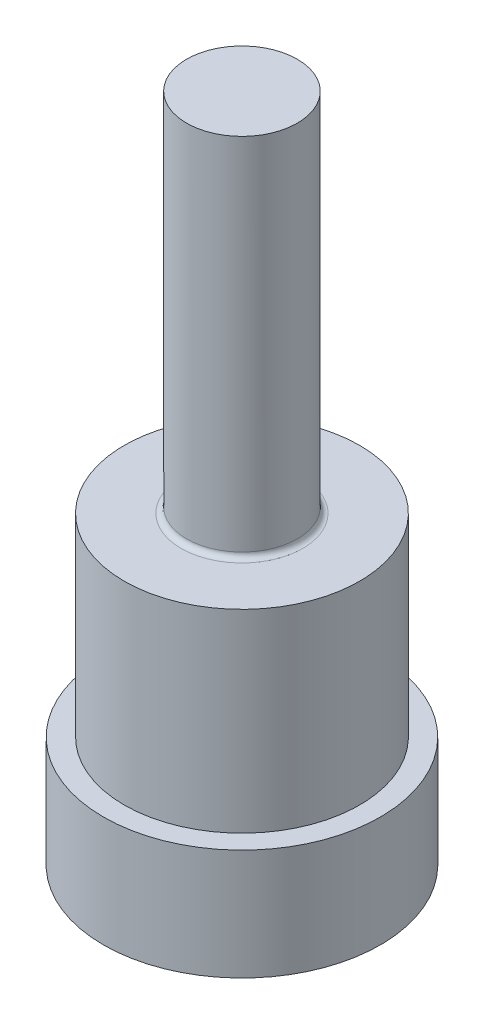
ISO-10303-21;
HEADER;
FILE_DESCRIPTION(('STEP AP214'),'2;1');
FILE_NAME('part.step','',(''),(''),'','','');
FILE_SCHEMA(('AUTOMOTIVE_DESIGN { 1 0 10303 214 1 1 1 1 }'));
ENDSEC;
DATA;
#1=APPLICATION_CONTEXT('core data for automotive mechanical design processes');
#2=APPLICATION_PROTOCOL_DEFINITION('international standard','automotive_design',2000,#1);
#3=PRODUCT_CONTEXT('',#1,'mechanical');
#4=PRODUCT('Part','Part','',(#3));
#5=PRODUCT_RELATED_PRODUCT_CATEGORY('part','',(#4));
#6=PRODUCT_DEFINITION_FORMATION('','',#4);
#7=PRODUCT_DEFINITION_CONTEXT('part definition',#1,'design');
#8=PRODUCT_DEFINITION('design','',#6,#7);
#9=PRODUCT_DEFINITION_SHAPE('','',#8);
#10=(LENGTH_UNIT() NAMED_UNIT(*) SI_UNIT(.MILLI.,.METRE.));
#11=(NAMED_UNIT(*) PLANE_ANGLE_UNIT() SI_UNIT($,.RADIAN.));
#12=(NAMED_UNIT(*) SI_UNIT($,.STERADIAN.) SOLID_ANGLE_UNIT());
#13=UNCERTAINTY_MEASURE_WITH_UNIT(LENGTH_MEASURE(1.E-05),#10,'distance_accuracy_value','');
#14=(GEOMETRIC_REPRESENTATION_CONTEXT(3) GLOBAL_UNCERTAINTY_ASSIGNED_CONTEXT((#13)) GLOBAL_UNIT_ASSIGNED_CONTEXT((#10,
#11,#12)) REPRESENTATION_CONTEXT('',''));
#15=CARTESIAN_POINT('',(0.,0.,0.));
#16=DIRECTION('',(0.,0.,1.));
#17=DIRECTION('',(1.,0.,0.));
#18=AXIS2_PLACEMENT_3D('',#15,#16,#17);
#19=CARTESIAN_POINT('',(0.,-6.,0.));
#20=DIRECTION('',(0.,-1.,0.));
#21=DIRECTION('',(0.,0.,1.));
#22=AXIS2_PLACEMENT_3D('',#19,#20,#21);
#23=PLANE('',#22);
#24=CARTESIAN_POINT('',(0.,-6.,0.));
#25=DIRECTION('',(0.,1.,0.));
#26=DIRECTION('',(0.,0.,1.));
#27=AXIS2_PLACEMENT_3D('',#24,#25,#26);
#28=CIRCLE('',#27,5.);
#29=CARTESIAN_POINT('',(0.,-6.,5.));
#30=VERTEX_POINT('',#29);
#31=EDGE_CURVE('E363',#30,#30,#28,.T.);
#32=ORIENTED_EDGE('',*,*,#31,.F.);
#33=EDGE_LOOP('',(#32));
#34=FACE_BOUND('',#33,.T.);
#35=CARTESIAN_POINT('',(0.,-6.,0.));
#36=DIRECTION('',(0.,-1.,0.));
#37=DIRECTION('',(0.,0.,1.));
#38=AXIS2_PLACEMENT_3D('',#35,#36,#37);
#39=CIRCLE('',#38,3.2);
#40=CARTESIAN_POINT('',(0.,-6.,3.2));
#41=VERTEX_POINT('',#40);
#42=EDGE_CURVE('E129',#41,#41,#39,.F.);
#43=ORIENTED_EDGE('',*,*,#42,.T.);
#44=EDGE_LOOP('',(#43));
#45=FACE_BOUND('',#44,.T.);
#46=ADVANCED_FACE('F15',(#34,#45),#23,.T.);
#47=CARTESIAN_POINT('',(0.,-3.,0.));
#48=DIRECTION('',(0.,-1.,0.));
#49=DIRECTION('',(0.,0.,1.));
#50=AXIS2_PLACEMENT_3D('',#47,#48,#49);
#51=CYLINDRICAL_SURFACE('',#50,3.);
#52=CARTESIAN_POINT('',(0.,-5.8,0.));
#53=DIRECTION('',(0.,-1.,0.));
#54=DIRECTION('',(0.,0.,1.));
#55=AXIS2_PLACEMENT_3D('',#52,#53,#54);
#56=CIRCLE('',#55,3.);
#57=CARTESIAN_POINT('',(0.,-5.8,3.));
#58=VERTEX_POINT('',#57);
#59=EDGE_CURVE('E132',#58,#58,#56,.T.);
#60=ORIENTED_EDGE('',*,*,#59,.T.);
#61=EDGE_LOOP('',(#60));
#62=FACE_BOUND('',#61,.T.);
#63=CARTESIAN_POINT('',(0.,-3.,0.));
#64=DIRECTION('',(0.,-1.,0.));
#65=DIRECTION('',(0.,0.,1.));
#66=AXIS2_PLACEMENT_3D('',#63,#64,#65);
#67=CIRCLE('',#66,3.);
#68=CARTESIAN_POINT('',(0.,-3.,3.));
#69=VERTEX_POINT('',#68);
#70=EDGE_CURVE('E126',#69,#69,#67,.T.);
#71=ORIENTED_EDGE('',*,*,#70,.F.);
#72=EDGE_LOOP('',(#71));
#73=FACE_BOUND('',#72,.T.);
#74=ADVANCED_FACE('F153',(#62,#73),#51,.F.);
#75=CARTESIAN_POINT('',(0.,-5.8,0.));
#76=DIRECTION('',(0.,-1.,0.));
#77=DIRECTION('',(0.,0.,1.));
#78=AXIS2_PLACEMENT_3D('',#75,#76,#77);
#79=CONICAL_SURFACE('',#78,3.,0.78539816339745);
#80=ORIENTED_EDGE('',*,*,#42,.F.);
#81=EDGE_LOOP('',(#80));
#82=FACE_BOUND('',#81,.T.);
#83=ORIENTED_EDGE('',*,*,#59,.F.);
#84=EDGE_LOOP('',(#83));
#85=FACE_BOUND('',#84,.T.);
#86=ADVANCED_FACE('F149',(#82,#85),#79,.F.);
#87=CARTESIAN_POINT('',(0.,-3.,0.));
#88=DIRECTION('',(0.,-1.,0.));
#89=DIRECTION('',(0.,0.,-1.));
#90=AXIS2_PLACEMENT_3D('',#87,#88,#89);
#91=PLANE('',#90);
#92=CARTESIAN_POINT('',(0.,-3.,0.));
#93=DIRECTION('',(0.,-1.,0.));
#94=DIRECTION('',(0.,0.,-1.));
#95=AXIS2_PLACEMENT_3D('',#92,#93,#94);
#96=CIRCLE('',#95,2.75);
#97=CARTESIAN_POINT('',(0.,-3.,-2.75));
#98=VERTEX_POINT('',#97);
#99=EDGE_CURVE('E23',#98,#98,#96,.T.);
#100=ORIENTED_EDGE('',*,*,#99,.F.);
#101=EDGE_LOOP('',(#100));
#102=FACE_BOUND('',#101,.T.);
#103=ORIENTED_EDGE('',*,*,#70,.T.);
#104=EDGE_LOOP('',(#103));
#105=FACE_BOUND('',#104,.T.);
#106=ADVANCED_FACE('F146',(#102,#105),#91,.T.);
#107=CARTESIAN_POINT('',(0.,-11.,0.));
#108=DIRECTION('',(0.,-1.,0.));
#109=DIRECTION('',(-1.,0.,0.));
#110=AXIS2_PLACEMENT_3D('',#107,#108,#109);
#111=CYLINDRICAL_SURFACE('',#110,2.75);
#112=ORIENTED_EDGE('',*,*,#99,.T.);
#113=EDGE_LOOP('',(#112));
#114=FACE_BOUND('',#113,.T.);
#115=CARTESIAN_POINT('',(0.,-5.,0.));
#116=DIRECTION('',(0.,-1.,0.));
#117=DIRECTION('',(-1.,0.,0.));
#118=AXIS2_PLACEMENT_3D('',#115,#116,#117);
#119=CIRCLE('',#118,2.75);
#120=CARTESIAN_POINT('',(-2.75,-5.00000000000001,0.));
#121=VERTEX_POINT('',#120);
#122=EDGE_CURVE('E118',#121,#121,#119,.T.);
#123=ORIENTED_EDGE('',*,*,#122,.F.);
#124=EDGE_LOOP('',(#123));
#125=FACE_BOUND('',#124,.T.);
#126=ADVANCED_FACE('F143',(#114,#125),#111,.T.);
#127=CARTESIAN_POINT('',(0.,-5.,0.));
#128=DIRECTION('',(0.,-1.,0.));
#129=DIRECTION('',(-1.,0.,0.));
#130=AXIS2_PLACEMENT_3D('',#127,#128,#129);
#131=PLANE('',#130);
#132=DIRECTION('',(0.866025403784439,0.,-0.5));
#133=VECTOR('',#132,1.);
#134=CARTESIAN_POINT('',(-1.,-5.,-0.577350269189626));
#135=LINE('',#134,#133);
#136=CARTESIAN_POINT('',(-1.,-5.,-0.577350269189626));
#137=VERTEX_POINT('',#136);
#138=CARTESIAN_POINT('',(0.,-5.,-1.15470053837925));
#139=VERTEX_POINT('',#138);
#140=EDGE_CURVE('E30',#137,#139,#135,.T.);
#141=ORIENTED_EDGE('',*,*,#140,.F.);
#142=DIRECTION('',(0.,0.,-1.));
#143=VECTOR('',#142,1.);
#144=CARTESIAN_POINT('',(-1.,-5.,0.577350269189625));
#145=LINE('',#144,#143);
#146=CARTESIAN_POINT('',(-1.,-5.,0.577350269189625));
#147=VERTEX_POINT('',#146);
#148=EDGE_CURVE('E114',#147,#137,#145,.T.);
#149=ORIENTED_EDGE('',*,*,#148,.F.);
#150=DIRECTION('',(-0.866025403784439,0.,-0.5));
#151=VECTOR('',#150,1.);
#152=CARTESIAN_POINT('',(0.,-5.,1.15470053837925));
#153=LINE('',#152,#151);
#154=CARTESIAN_POINT('',(0.,-5.,1.15470053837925));
#155=VERTEX_POINT('',#154);
#156=EDGE_CURVE('E112',#155,#147,#153,.T.);
#157=ORIENTED_EDGE('',*,*,#156,.F.);
#158=DIRECTION('',(-0.866025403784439,0.,0.5));
#159=VECTOR('',#158,1.);
#160=CARTESIAN_POINT('',(1.,-5.,0.577350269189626));
#161=LINE('',#160,#159);
#162=CARTESIAN_POINT('',(1.,-5.,0.577350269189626));
#163=VERTEX_POINT('',#162);
#164=EDGE_CURVE('E78',#163,#155,#161,.T.);
#165=ORIENTED_EDGE('',*,*,#164,.F.);
#166=DIRECTION('',(0.,0.,1.));
#167=VECTOR('',#166,1.);
#168=CARTESIAN_POINT('',(1.,-5.,-0.577350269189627));
#169=LINE('',#168,#167);
#170=CARTESIAN_POINT('',(1.,-5.,-0.577350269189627));
#171=VERTEX_POINT('',#170);
#172=EDGE_CURVE('E108',#171,#163,#169,.T.);
#173=ORIENTED_EDGE('',*,*,#172,.F.);
#174=DIRECTION('',(0.866025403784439,0.,0.5));
#175=VECTOR('',#174,1.);
#176=CARTESIAN_POINT('',(0.,-5.,-1.15470053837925));
#177=LINE('',#176,#175);
#178=EDGE_CURVE('E104',#139,#171,#177,.T.);
#179=ORIENTED_EDGE('',*,*,#178,.F.);
#180=EDGE_LOOP('',(#141,#149,#157,#165,#173,#179));
#181=FACE_BOUND('',#180,.T.);
#182=ORIENTED_EDGE('',*,*,#122,.T.);
#183=EDGE_LOOP('',(#182));
#184=FACE_BOUND('',#183,.T.);
#185=ADVANCED_FACE('F214',(#181,#184),#131,.T.);
#186=CARTESIAN_POINT('',(-1.,-3.5,-0.577350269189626));
#187=DIRECTION('',(-0.5,0.,-0.866025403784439));
#188=DIRECTION('',(0.866025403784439,0.,-0.5));
#189=AXIS2_PLACEMENT_3D('',#186,#187,#188);
#190=PLANE('',#189);
#191=ORIENTED_EDGE('',*,*,#140,.T.);
#192=DIRECTION('',(0.,-1.,0.));
#193=VECTOR('',#192,1.);
#194=CARTESIAN_POINT('',(0.,-3.5,-1.15470053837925));
#195=LINE('',#194,#193);
#196=CARTESIAN_POINT('',(0.,-3.5,-1.15470053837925));
#197=VERTEX_POINT('',#196);
#198=EDGE_CURVE('E60',#197,#139,#195,.T.);
#199=ORIENTED_EDGE('',*,*,#198,.F.);
#200=DIRECTION('',(0.866025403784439,0.,-0.5));
#201=VECTOR('',#200,1.);
#202=CARTESIAN_POINT('',(-1.,-3.5,-0.577350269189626));
#203=LINE('',#202,#201);
#204=CARTESIAN_POINT('',(-1.,-3.5,-0.577350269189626));
#205=VERTEX_POINT('',#204);
#206=EDGE_CURVE('E116',#205,#197,#203,.T.);
#207=ORIENTED_EDGE('',*,*,#206,.F.);
#208=DIRECTION('',(0.,-1.,0.));
#209=VECTOR('',#208,1.);
#210=CARTESIAN_POINT('',(-1.,-3.5,-0.577350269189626));
#211=LINE('',#210,#209);
#212=EDGE_CURVE('E38',#205,#137,#211,.T.);
#213=ORIENTED_EDGE('',*,*,#212,.T.);
#214=EDGE_LOOP('',(#191,#199,#207,#213));
#215=FACE_BOUND('',#214,.T.);
#216=ADVANCED_FACE('F219',(#215),#190,.F.);
#217=CARTESIAN_POINT('',(-1.,-3.5,0.577350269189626));
#218=DIRECTION('',(-1.,0.,0.));
#219=DIRECTION('',(0.,1.,0.));
#220=AXIS2_PLACEMENT_3D('',#217,#218,#219);
#221=PLANE('',#220);
#222=ORIENTED_EDGE('',*,*,#148,.T.);
#223=ORIENTED_EDGE('',*,*,#212,.F.);
#224=DIRECTION('',(0.,0.,-1.));
#225=VECTOR('',#224,1.);
#226=CARTESIAN_POINT('',(-1.,-3.5,0.577350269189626));
#227=LINE('',#226,#225);
#228=CARTESIAN_POINT('',(-1.,-3.5,0.577350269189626));
#229=VERTEX_POINT('',#228);
#230=EDGE_CURVE('E90',#229,#205,#227,.T.);
#231=ORIENTED_EDGE('',*,*,#230,.F.);
#232=DIRECTION('',(0.,-1.,0.));
#233=VECTOR('',#232,1.);
#234=CARTESIAN_POINT('',(-1.,-3.5,0.577350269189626));
#235=LINE('',#234,#233);
#236=EDGE_CURVE('E82',#229,#147,#235,.T.);
#237=ORIENTED_EDGE('',*,*,#236,.T.);
#238=EDGE_LOOP('',(#222,#223,#231,#237));
#239=FACE_BOUND('',#238,.T.);
#240=ADVANCED_FACE('F217',(#239),#221,.F.);
#241=CARTESIAN_POINT('',(0.,-3.5,1.15470053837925));
#242=DIRECTION('',(-0.5,0.,0.866025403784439));
#243=DIRECTION('',(-0.866025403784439,0.,-0.5));
#244=AXIS2_PLACEMENT_3D('',#241,#242,#243);
#245=PLANE('',#244);
#246=ORIENTED_EDGE('',*,*,#156,.T.);
#247=ORIENTED_EDGE('',*,*,#236,.F.);
#248=DIRECTION('',(-0.866025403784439,0.,-0.5));
#249=VECTOR('',#248,1.);
#250=CARTESIAN_POINT('',(0.,-3.5,1.15470053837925));
#251=LINE('',#250,#249);
#252=CARTESIAN_POINT('',(0.,-3.5,1.15470053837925));
#253=VERTEX_POINT('',#252);
#254=EDGE_CURVE('E86',#253,#229,#251,.T.);
#255=ORIENTED_EDGE('',*,*,#254,.F.);
#256=DIRECTION('',(0.,-1.,0.));
#257=VECTOR('',#256,1.);
#258=CARTESIAN_POINT('',(0.,-3.5,1.15470053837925));
#259=LINE('',#258,#257);
#260=EDGE_CURVE('E71',#253,#155,#259,.T.);
#261=ORIENTED_EDGE('',*,*,#260,.T.);
#262=EDGE_LOOP('',(#246,#247,#255,#261));
#263=FACE_BOUND('',#262,.T.);
#264=ADVANCED_FACE('F87',(#263),#245,.F.);
#265=CARTESIAN_POINT('',(1.,-3.5,0.577350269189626));
#266=DIRECTION('',(0.5,0.,0.866025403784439));
#267=DIRECTION('',(-0.866025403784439,0.,0.5));
#268=AXIS2_PLACEMENT_3D('',#265,#266,#267);
#269=PLANE('',#268);
#270=ORIENTED_EDGE('',*,*,#164,.T.);
#271=ORIENTED_EDGE('',*,*,#260,.F.);
#272=DIRECTION('',(-0.866025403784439,0.,0.5));
#273=VECTOR('',#272,1.);
#274=CARTESIAN_POINT('',(1.,-3.5,0.577350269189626));
#275=LINE('',#274,#273);
#276=CARTESIAN_POINT('',(1.,-3.5,0.577350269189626));
#277=VERTEX_POINT('',#276);
#278=EDGE_CURVE('E75',#277,#253,#275,.T.);
#279=ORIENTED_EDGE('',*,*,#278,.F.);
#280=DIRECTION('',(0.,-1.,0.));
#281=VECTOR('',#280,1.);
#282=CARTESIAN_POINT('',(1.,-3.5,0.577350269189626));
#283=LINE('',#282,#281);
#284=EDGE_CURVE('E83',#277,#163,#283,.T.);
#285=ORIENTED_EDGE('',*,*,#284,.T.);
#286=EDGE_LOOP('',(#270,#271,#279,#285));
#287=FACE_BOUND('',#286,.T.);
#288=ADVANCED_FACE('F73',(#287),#269,.F.);
#289=CARTESIAN_POINT('',(1.,-3.5,-0.577350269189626));
#290=DIRECTION('',(1.,0.,0.));
#291=DIRECTION('',(0.,-1.,0.));
#292=AXIS2_PLACEMENT_3D('',#289,#290,#291);
#293=PLANE('',#292);
#294=ORIENTED_EDGE('',*,*,#172,.T.);
#295=ORIENTED_EDGE('',*,*,#284,.F.);
#296=DIRECTION('',(0.,0.,1.));
#297=VECTOR('',#296,1.);
#298=CARTESIAN_POINT('',(1.,-3.5,-0.577350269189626));
#299=LINE('',#298,#297);
#300=CARTESIAN_POINT('',(1.,-3.5,-0.577350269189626));
#301=VERTEX_POINT('',#300);
#302=EDGE_CURVE('E96',#301,#277,#299,.T.);
#303=ORIENTED_EDGE('',*,*,#302,.F.);
#304=DIRECTION('',(0.,-1.,0.));
#305=VECTOR('',#304,1.);
#306=CARTESIAN_POINT('',(1.,-3.5,-0.577350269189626));
#307=LINE('',#306,#305);
#308=EDGE_CURVE('E121',#301,#171,#307,.T.);
#309=ORIENTED_EDGE('',*,*,#308,.T.);
#310=EDGE_LOOP('',(#294,#295,#303,#309));
#311=FACE_BOUND('',#310,.T.);
#312=ADVANCED_FACE('F212',(#311),#293,.F.);
#313=CARTESIAN_POINT('',(0.,-3.5,-1.15470053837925));
#314=DIRECTION('',(0.5,0.,-0.866025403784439));
#315=DIRECTION('',(0.866025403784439,0.,0.5));
#316=AXIS2_PLACEMENT_3D('',#313,#314,#315);
#317=PLANE('',#316);
#318=ORIENTED_EDGE('',*,*,#178,.T.);
#319=ORIENTED_EDGE('',*,*,#308,.F.);
#320=DIRECTION('',(0.866025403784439,0.,0.5));
#321=VECTOR('',#320,1.);
#322=CARTESIAN_POINT('',(0.,-3.5,-1.15470053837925));
#323=LINE('',#322,#321);
#324=EDGE_CURVE('E98',#197,#301,#323,.T.);
#325=ORIENTED_EDGE('',*,*,#324,.F.);
#326=ORIENTED_EDGE('',*,*,#198,.T.);
#327=EDGE_LOOP('',(#318,#319,#325,#326));
#328=FACE_BOUND('',#327,.T.);
#329=ADVANCED_FACE('F196',(#328),#317,.F.);
#330=CARTESIAN_POINT('',(0.,-3.5,0.));
#331=DIRECTION('',(0.,-1.,0.));
#332=DIRECTION('',(-1.,0.,0.));
#333=AXIS2_PLACEMENT_3D('',#330,#331,#332);
#334=PLANE('',#333);
#335=ORIENTED_EDGE('',*,*,#206,.T.);
#336=ORIENTED_EDGE('',*,*,#324,.T.);
#337=ORIENTED_EDGE('',*,*,#302,.T.);
#338=ORIENTED_EDGE('',*,*,#278,.T.);
#339=ORIENTED_EDGE('',*,*,#254,.T.);
#340=ORIENTED_EDGE('',*,*,#230,.T.);
#341=EDGE_LOOP('',(#335,#336,#337,#338,#339,#340));
#342=FACE_BOUND('',#341,.T.);
#343=ADVANCED_FACE('F93',(#342),#334,.T.);
#344=CARTESIAN_POINT('',(0.,18.2,0.));
#345=DIRECTION('',(0.,1.,0.));
#346=DIRECTION('',(0.,0.,1.));
#347=AXIS2_PLACEMENT_3D('',#344,#345,#346);
#348=PLANE('',#347);
#349=CARTESIAN_POINT('',(0.,18.2,0.));
#350=DIRECTION('',(0.,-1.,0.));
#351=DIRECTION('',(0.,0.,-1.));
#352=AXIS2_PLACEMENT_3D('',#349,#350,#351);
#353=CIRCLE('',#352,2.);
#354=CARTESIAN_POINT('',(0.,18.2,-2.));
#355=VERTEX_POINT('',#354);
#356=EDGE_CURVE('E105',#355,#355,#353,.T.);
#357=ORIENTED_EDGE('',*,*,#356,.F.);
#358=EDGE_LOOP('',(#357));
#359=FACE_BOUND('',#358,.T.);
#360=ADVANCED_FACE('F188',(#359),#348,.T.);
#361=CARTESIAN_POINT('',(0.,-2.,0.));
#362=DIRECTION('',(0.,-1.,0.));
#363=DIRECTION('',(0.,0.,-1.));
#364=AXIS2_PLACEMENT_3D('',#361,#362,#363);
#365=CYLINDRICAL_SURFACE('',#364,2.);
#366=CARTESIAN_POINT('',(0.,5.2,0.));
#367=DIRECTION('',(0.,1.,0.));
#368=DIRECTION('',(0.,0.,1.));
#369=AXIS2_PLACEMENT_3D('',#366,#367,#368);
#370=CIRCLE('',#369,2.);
#371=CARTESIAN_POINT('',(0.,5.2,2.));
#372=VERTEX_POINT('',#371);
#373=EDGE_CURVE('E138',#372,#372,#370,.T.);
#374=ORIENTED_EDGE('',*,*,#373,.T.);
#375=EDGE_LOOP('',(#374));
#376=FACE_BOUND('',#375,.T.);
#377=ORIENTED_EDGE('',*,*,#356,.T.);
#378=EDGE_LOOP('',(#377));
#379=FACE_BOUND('',#378,.T.);
#380=ADVANCED_FACE('F186',(#376,#379),#365,.T.);
#381=CARTESIAN_POINT('',(0.,5.2,0.));
#382=DIRECTION('',(0.,1.,0.));
#383=DIRECTION('',(0.,0.,1.));
#384=AXIS2_PLACEMENT_3D('',#381,#382,#383);
#385=TOROIDAL_SURFACE('',#384,2.2,0.2);
#386=ORIENTED_EDGE('',*,*,#373,.F.);
#387=EDGE_LOOP('',(#386));
#388=FACE_BOUND('',#387,.T.);
#389=CARTESIAN_POINT('',(0.,5.,0.));
#390=DIRECTION('',(0.,1.,0.));
#391=DIRECTION('',(0.,0.,1.));
#392=AXIS2_PLACEMENT_3D('',#389,#390,#391);
#393=CIRCLE('',#392,2.2);
#394=CARTESIAN_POINT('',(0.,5.,2.2));
#395=VERTEX_POINT('',#394);
#396=EDGE_CURVE('E135',#395,#395,#393,.F.);
#397=ORIENTED_EDGE('',*,*,#396,.F.);
#398=EDGE_LOOP('',(#397));
#399=FACE_BOUND('',#398,.T.);
#400=ADVANCED_FACE('F17',(#388,#399),#385,.F.);
#401=CARTESIAN_POINT('',(4.25,5.,0.));
#402=DIRECTION('',(0.,1.,0.));
#403=DIRECTION('',(0.,0.,1.));
#404=AXIS2_PLACEMENT_3D('',#401,#402,#403);
#405=PLANE('',#404);
#406=CARTESIAN_POINT('',(0.,5.,0.));
#407=DIRECTION('',(0.,1.,0.));
#408=DIRECTION('',(0.,0.,1.));
#409=AXIS2_PLACEMENT_3D('',#406,#407,#408);
#410=CIRCLE('',#409,4.25);
#411=CARTESIAN_POINT('',(0.,5.,4.25));
#412=VERTEX_POINT('',#411);
#413=EDGE_CURVE('E201',#412,#412,#410,.T.);
#414=ORIENTED_EDGE('',*,*,#413,.T.);
#415=EDGE_LOOP('',(#414));
#416=FACE_BOUND('',#415,.T.);
#417=ORIENTED_EDGE('',*,*,#396,.T.);
#418=EDGE_LOOP('',(#417));
#419=FACE_BOUND('',#418,.T.);
#420=ADVANCED_FACE('F181',(#416,#419),#405,.T.);
#421=CARTESIAN_POINT('',(0.,-2.,0.));
#422=DIRECTION('',(0.,-1.,0.));
#423=DIRECTION('',(0.,0.,-1.));
#424=AXIS2_PLACEMENT_3D('',#421,#422,#423);
#425=CYLINDRICAL_SURFACE('',#424,4.25);
#426=ORIENTED_EDGE('',*,*,#413,.F.);
#427=EDGE_LOOP('',(#426));
#428=FACE_BOUND('',#427,.T.);
#429=CARTESIAN_POINT('',(0.,-2.,0.));
#430=DIRECTION('',(0.,-1.,0.));
#431=DIRECTION('',(0.,0.,-1.));
#432=AXIS2_PLACEMENT_3D('',#429,#430,#431);
#433=CIRCLE('',#432,4.25);
#434=CARTESIAN_POINT('',(0.,-2.,-4.25));
#435=VERTEX_POINT('',#434);
#436=EDGE_CURVE('E9',#435,#435,#433,.F.);
#437=ORIENTED_EDGE('',*,*,#436,.T.);
#438=EDGE_LOOP('',(#437));
#439=FACE_BOUND('',#438,.T.);
#440=ADVANCED_FACE('F174',(#428,#439),#425,.T.);
#441=CARTESIAN_POINT('',(0.,-2.,0.));
#442=DIRECTION('',(0.,-1.,0.));
#443=DIRECTION('',(0.,0.,1.));
#444=AXIS2_PLACEMENT_3D('',#441,#442,#443);
#445=PLANE('',#444);
#446=ORIENTED_EDGE('',*,*,#436,.F.);
#447=EDGE_LOOP('',(#446));
#448=FACE_BOUND('',#447,.T.);
#449=CARTESIAN_POINT('',(0.,-2.,0.));
#450=DIRECTION('',(0.,1.,0.));
#451=DIRECTION('',(0.,0.,1.));
#452=AXIS2_PLACEMENT_3D('',#449,#450,#451);
#453=CIRCLE('',#452,5.);
#454=CARTESIAN_POINT('',(0.,-2.,5.));
#455=VERTEX_POINT('',#454);
#456=EDGE_CURVE('E204',#455,#455,#453,.T.);
#457=ORIENTED_EDGE('',*,*,#456,.T.);
#458=EDGE_LOOP('',(#457));
#459=FACE_BOUND('',#458,.T.);
#460=ADVANCED_FACE('F170',(#448,#459),#445,.F.);
#461=CARTESIAN_POINT('',(0.,-6.,0.));
#462=DIRECTION('',(0.,1.,0.));
#463=DIRECTION('',(0.,0.,-1.));
#464=AXIS2_PLACEMENT_3D('',#461,#462,#463);
#465=CYLINDRICAL_SURFACE('',#464,5.);
#466=ORIENTED_EDGE('',*,*,#456,.F.);
#467=EDGE_LOOP('',(#466));
#468=FACE_BOUND('',#467,.T.);
#469=ORIENTED_EDGE('',*,*,#31,.T.);
#470=EDGE_LOOP('',(#469));
#471=FACE_BOUND('',#470,.T.);
#472=ADVANCED_FACE('F173',(#468,#471),#465,.T.);
#473=CLOSED_SHELL('',(#46,#74,#86,#106,#126,#185,#216,#240,#264,#288,#312,#329,#343,#360,#380,
#400,#420,#440,#460,#472));
#474=MANIFOLD_SOLID_BREP('B1',#473);
#475=ADVANCED_BREP_SHAPE_REPRESENTATION('',(#18,#474),#14);
#476=SHAPE_DEFINITION_REPRESENTATION(#9,#475);
ENDSEC;
END-ISO-10303-21;
